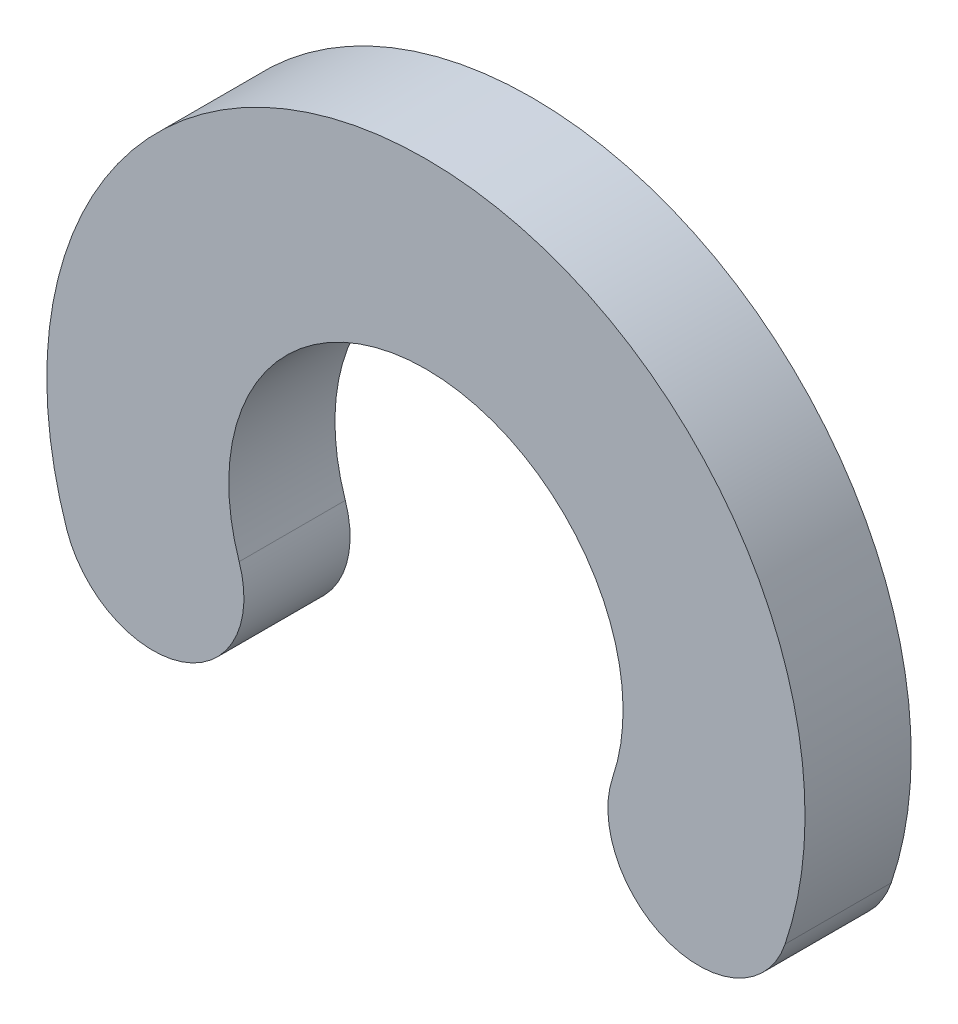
from build123d import *

# Parameters (mm, degrees)
BODY_DEPTH = 0.35


with BuildPart() as part:
    # Sketch1 → Body (new body)
    with BuildSketch(Plane.XY):
        with BuildLine():
            ThreePointArc((0.615789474, -0.208094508), (0, 0.65), (-0.615789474, -0.208094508))
            ThreePointArc((-0.615789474, -0.208094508), (-0.803956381, -0.588348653), (-1.184210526, -0.400181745))
            ThreePointArc((-1.184210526, -0.400181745), (0, 1.25), (1.184210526, -0.400181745))
            ThreePointArc((1.184210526, -0.400181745), (0.803956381, -0.588348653), (0.615789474, -0.208094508))
        make_face()
    extrude(amount=-BODY_DEPTH)


solid = part.part
